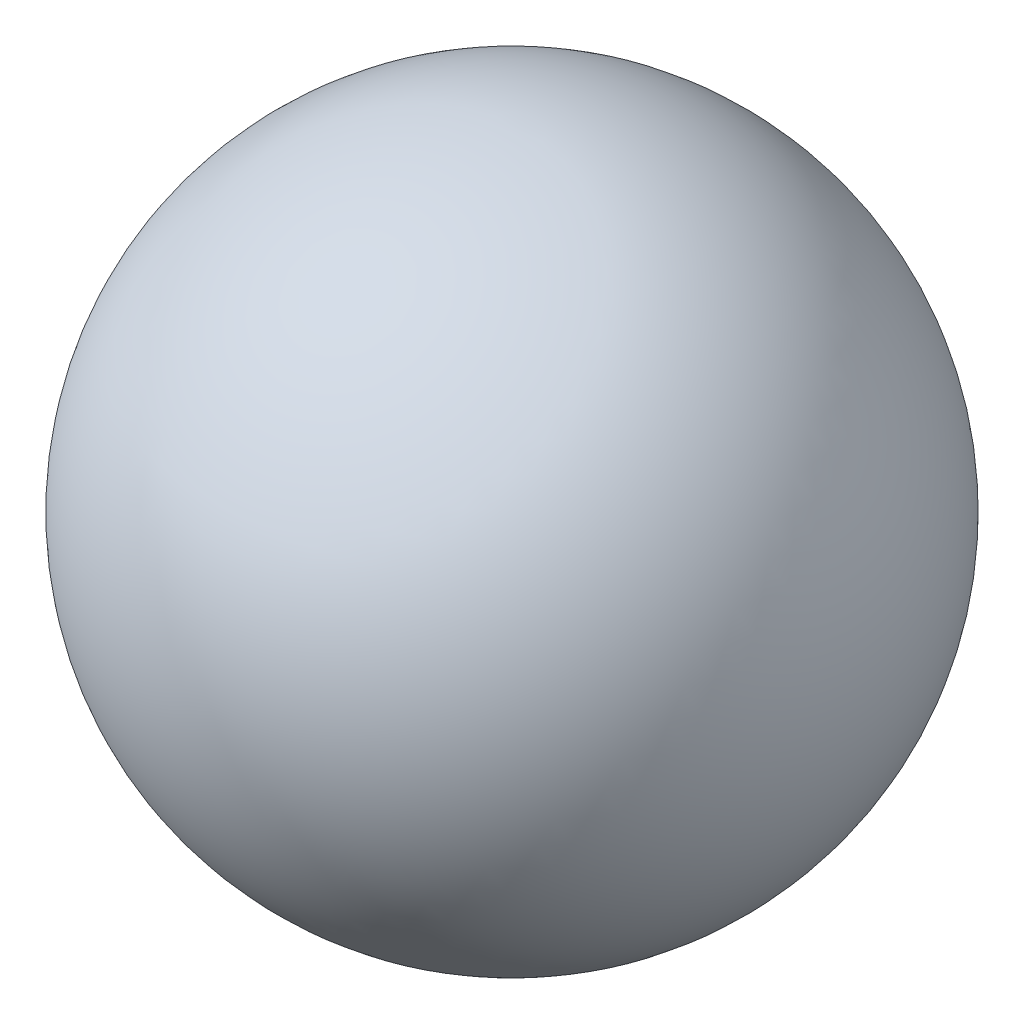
ISO-10303-21;
HEADER;
FILE_DESCRIPTION(('STEP AP214'),'2;1');
FILE_NAME('part.step','',(''),(''),'','','');
FILE_SCHEMA(('AUTOMOTIVE_DESIGN { 1 0 10303 214 1 1 1 1 }'));
ENDSEC;
DATA;
#1=APPLICATION_CONTEXT('core data for automotive mechanical design processes');
#2=APPLICATION_PROTOCOL_DEFINITION('international standard','automotive_design',2000,#1);
#3=PRODUCT_CONTEXT('',#1,'mechanical');
#4=PRODUCT('Part','Part','',(#3));
#5=PRODUCT_RELATED_PRODUCT_CATEGORY('part','',(#4));
#6=PRODUCT_DEFINITION_FORMATION('','',#4);
#7=PRODUCT_DEFINITION_CONTEXT('part definition',#1,'design');
#8=PRODUCT_DEFINITION('design','',#6,#7);
#9=PRODUCT_DEFINITION_SHAPE('','',#8);
#10=(LENGTH_UNIT() NAMED_UNIT(*) SI_UNIT(.MILLI.,.METRE.));
#11=(NAMED_UNIT(*) PLANE_ANGLE_UNIT() SI_UNIT($,.RADIAN.));
#12=(NAMED_UNIT(*) SI_UNIT($,.STERADIAN.) SOLID_ANGLE_UNIT());
#13=UNCERTAINTY_MEASURE_WITH_UNIT(LENGTH_MEASURE(1.E-05),#10,'distance_accuracy_value','');
#14=(GEOMETRIC_REPRESENTATION_CONTEXT(3) GLOBAL_UNCERTAINTY_ASSIGNED_CONTEXT((#13)) GLOBAL_UNIT_ASSIGNED_CONTEXT((#10,
#11,#12)) REPRESENTATION_CONTEXT('',''));
#15=CARTESIAN_POINT('',(0.,0.,0.));
#16=DIRECTION('',(0.,0.,1.));
#17=DIRECTION('',(1.,0.,0.));
#18=AXIS2_PLACEMENT_3D('',#15,#16,#17);
#19=CARTESIAN_POINT('',(0.,0.,0.));
#20=DIRECTION('',(0.,-1.,0.));
#21=DIRECTION('',(-1.,0.,0.));
#22=AXIS2_PLACEMENT_3D('',#19,#20,#21);
#23=SPHERICAL_SURFACE('',#22,60.);
#24=CARTESIAN_POINT('',(0.,-60.,0.));
#25=VERTEX_POINT('',#24);
#26=VERTEX_LOOP('',#25);
#27=FACE_BOUND('',#26,.T.);
#28=ADVANCED_FACE('F32',(#27),#23,.T.);
#29=CLOSED_SHELL('',(#28));
#30=MANIFOLD_SOLID_BREP('B2',#29);
#31=ADVANCED_BREP_SHAPE_REPRESENTATION('',(#18,#30),#14);
#32=SHAPE_DEFINITION_REPRESENTATION(#9,#31);
ENDSEC;
END-ISO-10303-21;
